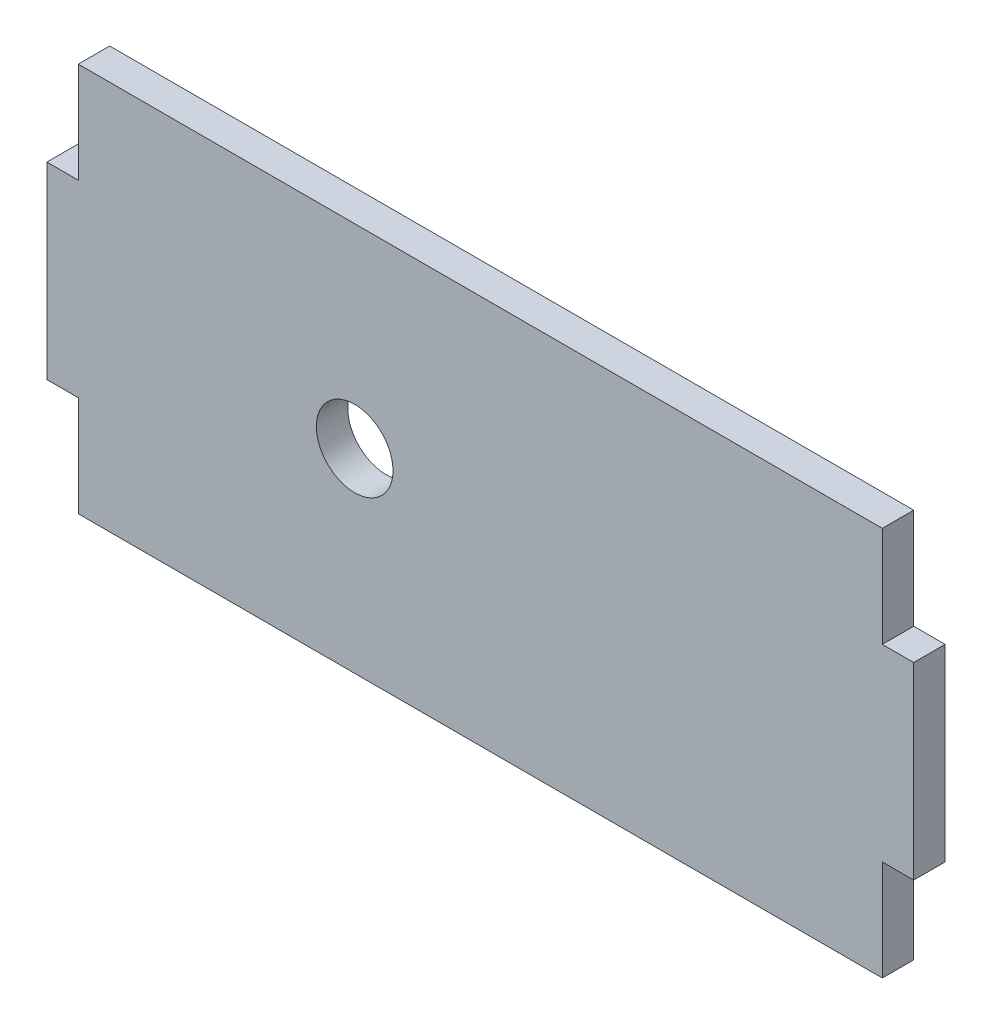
ISO-10303-21;
HEADER;
FILE_DESCRIPTION(('STEP AP214'),'2;1');
FILE_NAME('part.step','',(''),(''),'','','');
FILE_SCHEMA(('AUTOMOTIVE_DESIGN { 1 0 10303 214 1 1 1 1 }'));
ENDSEC;
DATA;
#1=APPLICATION_CONTEXT('core data for automotive mechanical design processes');
#2=APPLICATION_PROTOCOL_DEFINITION('international standard','automotive_design',2000,#1);
#3=PRODUCT_CONTEXT('',#1,'mechanical');
#4=PRODUCT('Part','Part','',(#3));
#5=PRODUCT_RELATED_PRODUCT_CATEGORY('part','',(#4));
#6=PRODUCT_DEFINITION_FORMATION('','',#4);
#7=PRODUCT_DEFINITION_CONTEXT('part definition',#1,'design');
#8=PRODUCT_DEFINITION('design','',#6,#7);
#9=PRODUCT_DEFINITION_SHAPE('','',#8);
#10=(LENGTH_UNIT() NAMED_UNIT(*) SI_UNIT(.MILLI.,.METRE.));
#11=(NAMED_UNIT(*) PLANE_ANGLE_UNIT() SI_UNIT($,.RADIAN.));
#12=(NAMED_UNIT(*) SI_UNIT($,.STERADIAN.) SOLID_ANGLE_UNIT());
#13=UNCERTAINTY_MEASURE_WITH_UNIT(LENGTH_MEASURE(1.E-05),#10,'distance_accuracy_value','');
#14=(GEOMETRIC_REPRESENTATION_CONTEXT(3) GLOBAL_UNCERTAINTY_ASSIGNED_CONTEXT((#13)) GLOBAL_UNIT_ASSIGNED_CONTEXT((#10,
#11,#12)) REPRESENTATION_CONTEXT('',''));
#15=CARTESIAN_POINT('',(0.,0.,0.));
#16=DIRECTION('',(0.,0.,1.));
#17=DIRECTION('',(1.,0.,0.));
#18=AXIS2_PLACEMENT_3D('',#15,#16,#17);
#19=CARTESIAN_POINT('',(0.,7.5,2.5));
#20=DIRECTION('',(-1.,0.,0.));
#21=DIRECTION('',(0.,-1.,0.));
#22=AXIS2_PLACEMENT_3D('',#19,#20,#21);
#23=PLANE('',#22);
#24=DIRECTION('',(0.,1.,0.));
#25=VECTOR('',#24,1.);
#26=CARTESIAN_POINT('',(0.,7.5,0.));
#27=LINE('',#26,#25);
#28=CARTESIAN_POINT('',(0.,7.5,0.));
#29=VERTEX_POINT('',#28);
#30=CARTESIAN_POINT('',(0.,15.5,0.));
#31=VERTEX_POINT('',#30);
#32=EDGE_CURVE('E157',#29,#31,#27,.T.);
#33=ORIENTED_EDGE('',*,*,#32,.F.);
#34=DIRECTION('',(0.,0.,-1.));
#35=VECTOR('',#34,1.);
#36=CARTESIAN_POINT('',(0.,7.5,2.5));
#37=LINE('',#36,#35);
#38=CARTESIAN_POINT('',(0.,7.5,2.5));
#39=VERTEX_POINT('',#38);
#40=EDGE_CURVE('E11',#39,#29,#37,.T.);
#41=ORIENTED_EDGE('',*,*,#40,.F.);
#42=DIRECTION('',(0.,1.,0.));
#43=VECTOR('',#42,1.);
#44=CARTESIAN_POINT('',(0.,7.5,2.5));
#45=LINE('',#44,#43);
#46=CARTESIAN_POINT('',(0.,15.5,2.5));
#47=VERTEX_POINT('',#46);
#48=EDGE_CURVE('E188',#39,#47,#45,.T.);
#49=ORIENTED_EDGE('',*,*,#48,.T.);
#50=DIRECTION('',(0.,0.,-1.));
#51=VECTOR('',#50,1.);
#52=CARTESIAN_POINT('',(0.,15.5,2.5));
#53=LINE('',#52,#51);
#54=EDGE_CURVE('E39',#47,#31,#53,.T.);
#55=ORIENTED_EDGE('',*,*,#54,.T.);
#56=EDGE_LOOP('',(#33,#41,#49,#55));
#57=FACE_BOUND('',#56,.T.);
#58=ADVANCED_FACE('F36',(#57),#23,.T.);
#59=CARTESIAN_POINT('',(-2.50000000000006,7.5,2.5));
#60=DIRECTION('',(0.,1.,0.));
#61=DIRECTION('',(0.,0.,1.));
#62=AXIS2_PLACEMENT_3D('',#59,#60,#61);
#63=PLANE('',#62);
#64=DIRECTION('',(1.,0.,0.));
#65=VECTOR('',#64,1.);
#66=CARTESIAN_POINT('',(-2.50000000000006,7.5,0.));
#67=LINE('',#66,#65);
#68=CARTESIAN_POINT('',(-2.50000000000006,7.5,0.));
#69=VERTEX_POINT('',#68);
#70=EDGE_CURVE('E186',#69,#29,#67,.T.);
#71=ORIENTED_EDGE('',*,*,#70,.F.);
#72=DIRECTION('',(0.,0.,-1.));
#73=VECTOR('',#72,1.);
#74=CARTESIAN_POINT('',(-2.50000000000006,7.5,2.5));
#75=LINE('',#74,#73);
#76=CARTESIAN_POINT('',(-2.50000000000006,7.5,2.5));
#77=VERTEX_POINT('',#76);
#78=EDGE_CURVE('E45',#77,#69,#75,.T.);
#79=ORIENTED_EDGE('',*,*,#78,.F.);
#80=DIRECTION('',(1.,0.,0.));
#81=VECTOR('',#80,1.);
#82=CARTESIAN_POINT('',(-2.50000000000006,7.5,2.5));
#83=LINE('',#82,#81);
#84=EDGE_CURVE('E137',#77,#39,#83,.T.);
#85=ORIENTED_EDGE('',*,*,#84,.T.);
#86=ORIENTED_EDGE('',*,*,#40,.T.);
#87=EDGE_LOOP('',(#71,#79,#85,#86));
#88=FACE_BOUND('',#87,.T.);
#89=ADVANCED_FACE('F211',(#88),#63,.T.);
#90=CARTESIAN_POINT('',(-2.50000000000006,7.5,2.5));
#91=DIRECTION('',(1.,0.,0.));
#92=DIRECTION('',(0.,0.,-1.));
#93=AXIS2_PLACEMENT_3D('',#90,#91,#92);
#94=PLANE('',#93);
#95=DIRECTION('',(0.,-1.,0.));
#96=VECTOR('',#95,1.);
#97=CARTESIAN_POINT('',(-2.50000000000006,7.5,0.));
#98=LINE('',#97,#96);
#99=CARTESIAN_POINT('',(-2.50000000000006,-7.5,0.));
#100=VERTEX_POINT('',#99);
#101=EDGE_CURVE('E142',#69,#100,#98,.T.);
#102=ORIENTED_EDGE('',*,*,#101,.T.);
#103=DIRECTION('',(0.,0.,-1.));
#104=VECTOR('',#103,1.);
#105=CARTESIAN_POINT('',(-2.50000000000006,-7.5,2.5));
#106=LINE('',#105,#104);
#107=CARTESIAN_POINT('',(-2.50000000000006,-7.5,2.5));
#108=VERTEX_POINT('',#107);
#109=EDGE_CURVE('E140',#108,#100,#106,.T.);
#110=ORIENTED_EDGE('',*,*,#109,.F.);
#111=DIRECTION('',(0.,-1.,0.));
#112=VECTOR('',#111,1.);
#113=CARTESIAN_POINT('',(-2.50000000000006,7.5,2.5));
#114=LINE('',#113,#112);
#115=EDGE_CURVE('E130',#77,#108,#114,.T.);
#116=ORIENTED_EDGE('',*,*,#115,.F.);
#117=ORIENTED_EDGE('',*,*,#78,.T.);
#118=EDGE_LOOP('',(#102,#110,#116,#117));
#119=FACE_BOUND('',#118,.T.);
#120=ADVANCED_FACE('F141',(#119),#94,.F.);
#121=CARTESIAN_POINT('',(-2.50000000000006,-7.5,2.5));
#122=DIRECTION('',(0.,1.,0.));
#123=DIRECTION('',(0.,0.,1.));
#124=AXIS2_PLACEMENT_3D('',#121,#122,#123);
#125=PLANE('',#124);
#126=DIRECTION('',(1.,0.,0.));
#127=VECTOR('',#126,1.);
#128=CARTESIAN_POINT('',(-2.50000000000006,-7.5,0.));
#129=LINE('',#128,#127);
#130=CARTESIAN_POINT('',(0.,-7.5,0.));
#131=VERTEX_POINT('',#130);
#132=EDGE_CURVE('E183',#100,#131,#129,.T.);
#133=ORIENTED_EDGE('',*,*,#132,.T.);
#134=DIRECTION('',(0.,0.,-1.));
#135=VECTOR('',#134,1.);
#136=CARTESIAN_POINT('',(0.,-7.5,2.5));
#137=LINE('',#136,#135);
#138=CARTESIAN_POINT('',(0.,-7.5,2.5));
#139=VERTEX_POINT('',#138);
#140=EDGE_CURVE('E146',#139,#131,#137,.T.);
#141=ORIENTED_EDGE('',*,*,#140,.F.);
#142=DIRECTION('',(1.,0.,0.));
#143=VECTOR('',#142,1.);
#144=CARTESIAN_POINT('',(-2.50000000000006,-7.5,2.5));
#145=LINE('',#144,#143);
#146=EDGE_CURVE('E135',#108,#139,#145,.T.);
#147=ORIENTED_EDGE('',*,*,#146,.F.);
#148=ORIENTED_EDGE('',*,*,#109,.T.);
#149=EDGE_LOOP('',(#133,#141,#147,#148));
#150=FACE_BOUND('',#149,.T.);
#151=ADVANCED_FACE('F148',(#150),#125,.F.);
#152=CARTESIAN_POINT('',(0.,-15.5,2.5));
#153=DIRECTION('',(-1.,0.,0.));
#154=DIRECTION('',(0.,-1.,0.));
#155=AXIS2_PLACEMENT_3D('',#152,#153,#154);
#156=PLANE('',#155);
#157=DIRECTION('',(0.,1.,0.));
#158=VECTOR('',#157,1.);
#159=CARTESIAN_POINT('',(0.,-15.5,0.));
#160=LINE('',#159,#158);
#161=CARTESIAN_POINT('',(0.,-15.5,0.));
#162=VERTEX_POINT('',#161);
#163=EDGE_CURVE('E180',#162,#131,#160,.T.);
#164=ORIENTED_EDGE('',*,*,#163,.F.);
#165=DIRECTION('',(0.,0.,-1.));
#166=VECTOR('',#165,1.);
#167=CARTESIAN_POINT('',(0.,-15.5,2.5));
#168=LINE('',#167,#166);
#169=CARTESIAN_POINT('',(0.,-15.5,2.5));
#170=VERTEX_POINT('',#169);
#171=EDGE_CURVE('E192',#170,#162,#168,.T.);
#172=ORIENTED_EDGE('',*,*,#171,.F.);
#173=DIRECTION('',(0.,1.,0.));
#174=VECTOR('',#173,1.);
#175=CARTESIAN_POINT('',(0.,-15.5,2.5));
#176=LINE('',#175,#174);
#177=EDGE_CURVE('E150',#170,#139,#176,.T.);
#178=ORIENTED_EDGE('',*,*,#177,.T.);
#179=ORIENTED_EDGE('',*,*,#140,.T.);
#180=EDGE_LOOP('',(#164,#172,#178,#179));
#181=FACE_BOUND('',#180,.T.);
#182=ADVANCED_FACE('F224',(#181),#156,.T.);
#183=CARTESIAN_POINT('',(0.,-15.5,2.5));
#184=DIRECTION('',(0.,1.,0.));
#185=DIRECTION('',(0.,0.,1.));
#186=AXIS2_PLACEMENT_3D('',#183,#184,#185);
#187=PLANE('',#186);
#188=DIRECTION('',(1.,0.,0.));
#189=VECTOR('',#188,1.);
#190=CARTESIAN_POINT('',(0.,-15.5,0.));
#191=LINE('',#190,#189);
#192=CARTESIAN_POINT('',(63.9999999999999,-15.5,0.));
#193=VERTEX_POINT('',#192);
#194=EDGE_CURVE('E178',#162,#193,#191,.T.);
#195=ORIENTED_EDGE('',*,*,#194,.T.);
#196=DIRECTION('',(0.,0.,-1.));
#197=VECTOR('',#196,1.);
#198=CARTESIAN_POINT('',(63.9999999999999,-15.5,2.5));
#199=LINE('',#198,#197);
#200=CARTESIAN_POINT('',(63.9999999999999,-15.5,2.5));
#201=VERTEX_POINT('',#200);
#202=EDGE_CURVE('E194',#201,#193,#199,.T.);
#203=ORIENTED_EDGE('',*,*,#202,.F.);
#204=DIRECTION('',(1.,0.,0.));
#205=VECTOR('',#204,1.);
#206=CARTESIAN_POINT('',(0.,-15.5,2.5));
#207=LINE('',#206,#205);
#208=EDGE_CURVE('E152',#170,#201,#207,.T.);
#209=ORIENTED_EDGE('',*,*,#208,.F.);
#210=ORIENTED_EDGE('',*,*,#171,.T.);
#211=EDGE_LOOP('',(#195,#203,#209,#210));
#212=FACE_BOUND('',#211,.T.);
#213=ADVANCED_FACE('F227',(#212),#187,.F.);
#214=CARTESIAN_POINT('',(63.9999999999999,-15.5,2.5));
#215=DIRECTION('',(-1.,0.,0.));
#216=DIRECTION('',(0.,-1.,0.));
#217=AXIS2_PLACEMENT_3D('',#214,#215,#216);
#218=PLANE('',#217);
#219=DIRECTION('',(0.,1.,0.));
#220=VECTOR('',#219,1.);
#221=CARTESIAN_POINT('',(63.9999999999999,-15.5,0.));
#222=LINE('',#221,#220);
#223=CARTESIAN_POINT('',(64.,-7.5,0.));
#224=VERTEX_POINT('',#223);
#225=EDGE_CURVE('E175',#193,#224,#222,.T.);
#226=ORIENTED_EDGE('',*,*,#225,.T.);
#227=DIRECTION('',(0.,0.,-1.));
#228=VECTOR('',#227,1.);
#229=CARTESIAN_POINT('',(64.,-7.5,2.5));
#230=LINE('',#229,#228);
#231=CARTESIAN_POINT('',(64.,-7.5,2.5));
#232=VERTEX_POINT('',#231);
#233=EDGE_CURVE('E197',#232,#224,#230,.T.);
#234=ORIENTED_EDGE('',*,*,#233,.F.);
#235=DIRECTION('',(0.,1.,0.));
#236=VECTOR('',#235,1.);
#237=CARTESIAN_POINT('',(63.9999999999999,-15.5,2.5));
#238=LINE('',#237,#236);
#239=EDGE_CURVE('E289',#201,#232,#238,.T.);
#240=ORIENTED_EDGE('',*,*,#239,.F.);
#241=ORIENTED_EDGE('',*,*,#202,.T.);
#242=EDGE_LOOP('',(#226,#234,#240,#241));
#243=FACE_BOUND('',#242,.T.);
#244=ADVANCED_FACE('F231',(#243),#218,.F.);
#245=CARTESIAN_POINT('',(66.5,-7.5,2.5));
#246=DIRECTION('',(0.,-1.,0.));
#247=DIRECTION('',(0.,0.,-1.));
#248=AXIS2_PLACEMENT_3D('',#245,#246,#247);
#249=PLANE('',#248);
#250=DIRECTION('',(-1.,0.,0.));
#251=VECTOR('',#250,1.);
#252=CARTESIAN_POINT('',(66.5,-7.5,0.));
#253=LINE('',#252,#251);
#254=CARTESIAN_POINT('',(66.5,-7.5,0.));
#255=VERTEX_POINT('',#254);
#256=EDGE_CURVE('E172',#255,#224,#253,.T.);
#257=ORIENTED_EDGE('',*,*,#256,.F.);
#258=DIRECTION('',(0.,0.,-1.));
#259=VECTOR('',#258,1.);
#260=CARTESIAN_POINT('',(66.5,-7.5,2.5));
#261=LINE('',#260,#259);
#262=CARTESIAN_POINT('',(66.5,-7.5,2.5));
#263=VERTEX_POINT('',#262);
#264=EDGE_CURVE('E199',#263,#255,#261,.T.);
#265=ORIENTED_EDGE('',*,*,#264,.F.);
#266=DIRECTION('',(-1.,0.,0.));
#267=VECTOR('',#266,1.);
#268=CARTESIAN_POINT('',(66.5,-7.5,2.5));
#269=LINE('',#268,#267);
#270=EDGE_CURVE('E286',#263,#232,#269,.T.);
#271=ORIENTED_EDGE('',*,*,#270,.T.);
#272=ORIENTED_EDGE('',*,*,#233,.T.);
#273=EDGE_LOOP('',(#257,#265,#271,#272));
#274=FACE_BOUND('',#273,.T.);
#275=ADVANCED_FACE('F235',(#274),#249,.T.);
#276=CARTESIAN_POINT('',(66.5,7.5,2.5));
#277=DIRECTION('',(1.,0.,0.));
#278=DIRECTION('',(0.,0.,-1.));
#279=AXIS2_PLACEMENT_3D('',#276,#277,#278);
#280=PLANE('',#279);
#281=DIRECTION('',(0.,-1.,0.));
#282=VECTOR('',#281,1.);
#283=CARTESIAN_POINT('',(66.5,7.5,0.));
#284=LINE('',#283,#282);
#285=CARTESIAN_POINT('',(66.5,7.5,0.));
#286=VERTEX_POINT('',#285);
#287=EDGE_CURVE('E169',#286,#255,#284,.T.);
#288=ORIENTED_EDGE('',*,*,#287,.F.);
#289=DIRECTION('',(0.,0.,-1.));
#290=VECTOR('',#289,1.);
#291=CARTESIAN_POINT('',(66.5,7.5,2.5));
#292=LINE('',#291,#290);
#293=CARTESIAN_POINT('',(66.5,7.5,2.5));
#294=VERTEX_POINT('',#293);
#295=EDGE_CURVE('E201',#294,#286,#292,.T.);
#296=ORIENTED_EDGE('',*,*,#295,.F.);
#297=DIRECTION('',(0.,-1.,0.));
#298=VECTOR('',#297,1.);
#299=CARTESIAN_POINT('',(66.5,7.5,2.5));
#300=LINE('',#299,#298);
#301=EDGE_CURVE('E283',#294,#263,#300,.T.);
#302=ORIENTED_EDGE('',*,*,#301,.T.);
#303=ORIENTED_EDGE('',*,*,#264,.T.);
#304=EDGE_LOOP('',(#288,#296,#302,#303));
#305=FACE_BOUND('',#304,.T.);
#306=ADVANCED_FACE('F239',(#305),#280,.T.);
#307=CARTESIAN_POINT('',(66.5,7.5,2.5));
#308=DIRECTION('',(0.,-1.,0.));
#309=DIRECTION('',(0.,0.,-1.));
#310=AXIS2_PLACEMENT_3D('',#307,#308,#309);
#311=PLANE('',#310);
#312=DIRECTION('',(-1.,0.,0.));
#313=VECTOR('',#312,1.);
#314=CARTESIAN_POINT('',(66.5,7.5,0.));
#315=LINE('',#314,#313);
#316=CARTESIAN_POINT('',(64.,7.5,0.));
#317=VERTEX_POINT('',#316);
#318=EDGE_CURVE('E167',#286,#317,#315,.T.);
#319=ORIENTED_EDGE('',*,*,#318,.T.);
#320=DIRECTION('',(0.,0.,-1.));
#321=VECTOR('',#320,1.);
#322=CARTESIAN_POINT('',(64.,7.5,2.5));
#323=LINE('',#322,#321);
#324=CARTESIAN_POINT('',(64.,7.5,2.5));
#325=VERTEX_POINT('',#324);
#326=EDGE_CURVE('E203',#325,#317,#323,.T.);
#327=ORIENTED_EDGE('',*,*,#326,.F.);
#328=DIRECTION('',(-1.,0.,0.));
#329=VECTOR('',#328,1.);
#330=CARTESIAN_POINT('',(66.5,7.5,2.5));
#331=LINE('',#330,#329);
#332=EDGE_CURVE('E281',#294,#325,#331,.T.);
#333=ORIENTED_EDGE('',*,*,#332,.F.);
#334=ORIENTED_EDGE('',*,*,#295,.T.);
#335=EDGE_LOOP('',(#319,#327,#333,#334));
#336=FACE_BOUND('',#335,.T.);
#337=ADVANCED_FACE('F243',(#336),#311,.F.);
#338=CARTESIAN_POINT('',(64.,7.5,2.5));
#339=DIRECTION('',(-1.,0.,0.));
#340=DIRECTION('',(0.,-1.,0.));
#341=AXIS2_PLACEMENT_3D('',#338,#339,#340);
#342=PLANE('',#341);
#343=DIRECTION('',(0.,1.,0.));
#344=VECTOR('',#343,1.);
#345=CARTESIAN_POINT('',(64.,7.5,0.));
#346=LINE('',#345,#344);
#347=CARTESIAN_POINT('',(63.9999999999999,15.5,0.));
#348=VERTEX_POINT('',#347);
#349=EDGE_CURVE('E164',#317,#348,#346,.T.);
#350=ORIENTED_EDGE('',*,*,#349,.T.);
#351=DIRECTION('',(0.,0.,-1.));
#352=VECTOR('',#351,1.);
#353=CARTESIAN_POINT('',(63.9999999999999,15.5,2.5));
#354=LINE('',#353,#352);
#355=CARTESIAN_POINT('',(63.9999999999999,15.5,2.5));
#356=VERTEX_POINT('',#355);
#357=EDGE_CURVE('E205',#356,#348,#354,.T.);
#358=ORIENTED_EDGE('',*,*,#357,.F.);
#359=DIRECTION('',(0.,1.,0.));
#360=VECTOR('',#359,1.);
#361=CARTESIAN_POINT('',(64.,7.5,2.5));
#362=LINE('',#361,#360);
#363=EDGE_CURVE('E279',#325,#356,#362,.T.);
#364=ORIENTED_EDGE('',*,*,#363,.F.);
#365=ORIENTED_EDGE('',*,*,#326,.T.);
#366=EDGE_LOOP('',(#350,#358,#364,#365));
#367=FACE_BOUND('',#366,.T.);
#368=ADVANCED_FACE('F247',(#367),#342,.F.);
#369=CARTESIAN_POINT('',(0.,15.5,2.5));
#370=DIRECTION('',(0.,1.,0.));
#371=DIRECTION('',(0.,0.,1.));
#372=AXIS2_PLACEMENT_3D('',#369,#370,#371);
#373=PLANE('',#372);
#374=DIRECTION('',(1.,0.,0.));
#375=VECTOR('',#374,1.);
#376=CARTESIAN_POINT('',(0.,15.5,0.));
#377=LINE('',#376,#375);
#378=EDGE_CURVE('E160',#31,#348,#377,.T.);
#379=ORIENTED_EDGE('',*,*,#378,.F.);
#380=ORIENTED_EDGE('',*,*,#54,.F.);
#381=DIRECTION('',(1.,0.,0.));
#382=VECTOR('',#381,1.);
#383=CARTESIAN_POINT('',(0.,15.5,2.5));
#384=LINE('',#383,#382);
#385=EDGE_CURVE('E277',#47,#356,#384,.T.);
#386=ORIENTED_EDGE('',*,*,#385,.T.);
#387=ORIENTED_EDGE('',*,*,#357,.T.);
#388=EDGE_LOOP('',(#379,#380,#386,#387));
#389=FACE_BOUND('',#388,.T.);
#390=ADVANCED_FACE('F207',(#389),#373,.T.);
#391=CARTESIAN_POINT('',(0.,0.,2.5));
#392=DIRECTION('',(0.,0.,-1.));
#393=DIRECTION('',(-1.,0.,0.));
#394=AXIS2_PLACEMENT_3D('',#391,#392,#393);
#395=PLANE('',#394);
#396=CARTESIAN_POINT('',(22.,0.,2.5));
#397=DIRECTION('',(0.,0.,1.));
#398=DIRECTION('',(1.,0.,0.));
#399=AXIS2_PLACEMENT_3D('',#396,#397,#398);
#400=CIRCLE('',#399,3.05);
#401=CARTESIAN_POINT('',(25.05,0.,2.5));
#402=VERTEX_POINT('',#401);
#403=EDGE_CURVE('E272',#402,#402,#400,.T.);
#404=ORIENTED_EDGE('',*,*,#403,.F.);
#405=EDGE_LOOP('',(#404));
#406=FACE_BOUND('',#405,.T.);
#407=ORIENTED_EDGE('',*,*,#48,.F.);
#408=ORIENTED_EDGE('',*,*,#84,.F.);
#409=ORIENTED_EDGE('',*,*,#115,.T.);
#410=ORIENTED_EDGE('',*,*,#146,.T.);
#411=ORIENTED_EDGE('',*,*,#177,.F.);
#412=ORIENTED_EDGE('',*,*,#208,.T.);
#413=ORIENTED_EDGE('',*,*,#239,.T.);
#414=ORIENTED_EDGE('',*,*,#270,.F.);
#415=ORIENTED_EDGE('',*,*,#301,.F.);
#416=ORIENTED_EDGE('',*,*,#332,.T.);
#417=ORIENTED_EDGE('',*,*,#363,.T.);
#418=ORIENTED_EDGE('',*,*,#385,.F.);
#419=EDGE_LOOP('',(#407,#408,#409,#410,#411,#412,#413,#414,#415,#416,#417,#418));
#420=FACE_BOUND('',#419,.T.);
#421=ADVANCED_FACE('F132',(#406,#420),#395,.F.);
#422=CARTESIAN_POINT('',(0.,0.,0.));
#423=DIRECTION('',(0.,0.,-1.));
#424=DIRECTION('',(-1.,0.,0.));
#425=AXIS2_PLACEMENT_3D('',#422,#423,#424);
#426=PLANE('',#425);
#427=CARTESIAN_POINT('',(22.,0.,0.));
#428=DIRECTION('',(0.,0.,1.));
#429=DIRECTION('',(1.,0.,0.));
#430=AXIS2_PLACEMENT_3D('',#427,#428,#429);
#431=CIRCLE('',#430,3.05);
#432=CARTESIAN_POINT('',(25.05,0.,0.));
#433=VERTEX_POINT('',#432);
#434=EDGE_CURVE('E161',#433,#433,#431,.T.);
#435=ORIENTED_EDGE('',*,*,#434,.T.);
#436=EDGE_LOOP('',(#435));
#437=FACE_BOUND('',#436,.T.);
#438=ORIENTED_EDGE('',*,*,#32,.T.);
#439=ORIENTED_EDGE('',*,*,#378,.T.);
#440=ORIENTED_EDGE('',*,*,#349,.F.);
#441=ORIENTED_EDGE('',*,*,#318,.F.);
#442=ORIENTED_EDGE('',*,*,#287,.T.);
#443=ORIENTED_EDGE('',*,*,#256,.T.);
#444=ORIENTED_EDGE('',*,*,#225,.F.);
#445=ORIENTED_EDGE('',*,*,#194,.F.);
#446=ORIENTED_EDGE('',*,*,#163,.T.);
#447=ORIENTED_EDGE('',*,*,#132,.F.);
#448=ORIENTED_EDGE('',*,*,#101,.F.);
#449=ORIENTED_EDGE('',*,*,#70,.T.);
#450=EDGE_LOOP('',(#438,#439,#440,#441,#442,#443,#444,#445,#446,#447,#448,#449));
#451=FACE_BOUND('',#450,.T.);
#452=ADVANCED_FACE('F210',(#437,#451),#426,.T.);
#453=CARTESIAN_POINT('',(22.,0.,0.));
#454=DIRECTION('',(0.,0.,1.));
#455=DIRECTION('',(1.,0.,0.));
#456=AXIS2_PLACEMENT_3D('',#453,#454,#455);
#457=CYLINDRICAL_SURFACE('',#456,3.05);
#458=ORIENTED_EDGE('',*,*,#434,.F.);
#459=EDGE_LOOP('',(#458));
#460=FACE_BOUND('',#459,.T.);
#461=ORIENTED_EDGE('',*,*,#403,.T.);
#462=EDGE_LOOP('',(#461));
#463=FACE_BOUND('',#462,.T.);
#464=ADVANCED_FACE('F259',(#460,#463),#457,.F.);
#465=CLOSED_SHELL('',(#58,#89,#120,#151,#182,#213,#244,#275,#306,#337,#368,#390,#421,#452,#464));
#466=MANIFOLD_SOLID_BREP('B2',#465);
#467=ADVANCED_BREP_SHAPE_REPRESENTATION('',(#18,#466),#14);
#468=SHAPE_DEFINITION_REPRESENTATION(#9,#467);
ENDSEC;
END-ISO-10303-21;
